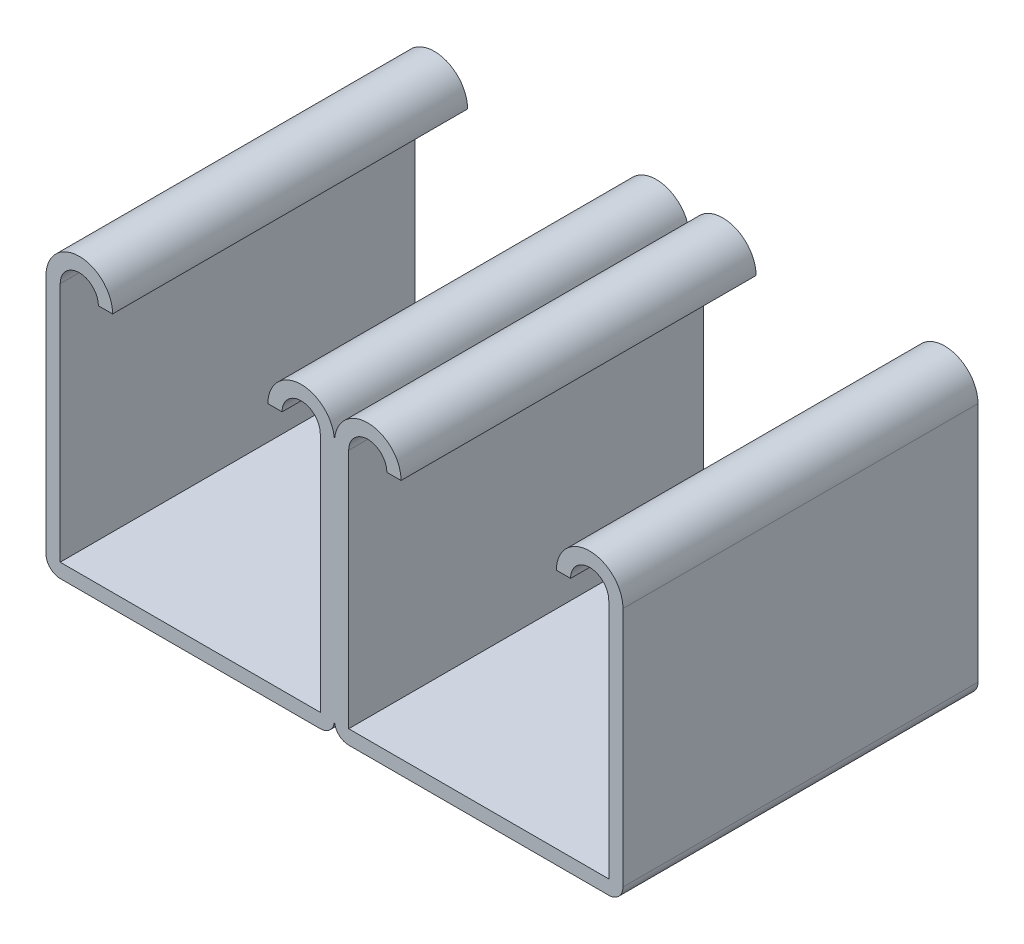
from build123d import *

# Parameters (mm, degrees)
BASE_EXTRUDE_DEPTH = 12.7
LPATTERN1_COUNT    = 2
LPATTERN1_PITCH    = 20.6375


with BuildPart() as part:
    # Sketch1 → Base-Extrude (new, symmetric)
    with BuildSketch(Plane.XY):
        with BuildLine():
            Line((-20.6375, 9.37895), (-20.6375, -7.874))
            ThreePointArc((-20.6375, -7.874), (-20.33992049, -8.59242049), (-19.6215, -8.89))
            Line((-19.6215, -8.89), (-1.016, -8.89))
            ThreePointArc((-1.016, -8.89), (-0.29757951, -8.59242049), (0, -7.874))
            Line((0, -7.874), (0, 9.37895))
            ThreePointArc((0, 9.37895), (-2.38125, 11.7602), (-4.7625, 9.37895))
            Line((-4.7625, 9.37895), (-3.7465, 9.37895))
            ThreePointArc((-3.7465, 9.37895), (-2.38125, 10.7442), (-1.016, 9.37895))
            Line((-1.016, 9.37895), (-1.016, -7.874))
            Line((-1.016, -7.874), (-19.6215, -7.874))
            Line((-19.6215, -7.874), (-19.6215, 9.37895))
            ThreePointArc((-19.6215, 9.37895), (-18.25625, 10.7442), (-16.891, 9.37895))
            Line((-16.891, 9.37895), (-15.875, 9.37895))
            ThreePointArc((-15.875, 9.37895), (-18.25625, 11.7602), (-20.6375, 9.37895))
        make_face()
    base_extrude = extrude(amount=BASE_EXTRUDE_DEPTH, both=True)

    # LPattern1: Base-Extrude ×2
    with Locations(*[(i * LPATTERN1_PITCH, 0, 0) for i in range(1, LPATTERN1_COUNT)]):
        add(base_extrude)


solid = part.part
